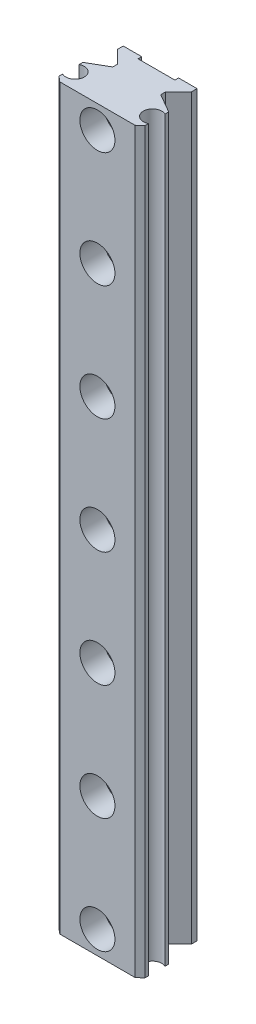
ISO-10303-21;
HEADER;
FILE_DESCRIPTION(('STEP AP214'),'2;1');
FILE_NAME('part.step','',(''),(''),'','','');
FILE_SCHEMA(('AUTOMOTIVE_DESIGN { 1 0 10303 214 1 1 1 1 }'));
ENDSEC;
DATA;
#1=APPLICATION_CONTEXT('core data for automotive mechanical design processes');
#2=APPLICATION_PROTOCOL_DEFINITION('international standard','automotive_design',2000,#1);
#3=PRODUCT_CONTEXT('',#1,'mechanical');
#4=PRODUCT('Part','Part','',(#3));
#5=PRODUCT_RELATED_PRODUCT_CATEGORY('part','',(#4));
#6=PRODUCT_DEFINITION_FORMATION('','',#4);
#7=PRODUCT_DEFINITION_CONTEXT('part definition',#1,'design');
#8=PRODUCT_DEFINITION('design','',#6,#7);
#9=PRODUCT_DEFINITION_SHAPE('','',#8);
#10=(LENGTH_UNIT() NAMED_UNIT(*) SI_UNIT(.MILLI.,.METRE.));
#11=(NAMED_UNIT(*) PLANE_ANGLE_UNIT() SI_UNIT($,.RADIAN.));
#12=(NAMED_UNIT(*) SI_UNIT($,.STERADIAN.) SOLID_ANGLE_UNIT());
#13=UNCERTAINTY_MEASURE_WITH_UNIT(LENGTH_MEASURE(1.E-05),#10,'distance_accuracy_value','');
#14=(GEOMETRIC_REPRESENTATION_CONTEXT(3) GLOBAL_UNCERTAINTY_ASSIGNED_CONTEXT((#13)) GLOBAL_UNIT_ASSIGNED_CONTEXT((#10,
#11,#12)) REPRESENTATION_CONTEXT('',''));
#15=CARTESIAN_POINT('',(0.,0.,0.));
#16=DIRECTION('',(0.,0.,1.));
#17=DIRECTION('',(1.,0.,0.));
#18=AXIS2_PLACEMENT_3D('',#15,#16,#17);
#19=CARTESIAN_POINT('',(0.,387.5,11.5));
#20=DIRECTION('',(0.,0.,1.));
#21=DIRECTION('',(0.,-1.,0.));
#22=AXIS2_PLACEMENT_3D('',#19,#20,#21);
#23=CYLINDRICAL_SURFACE('',#22,5.5);
#24=CARTESIAN_POINT('',(0.,387.5,1.99999999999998));
#25=DIRECTION('',(0.,0.,1.));
#26=DIRECTION('',(0.,-1.,0.));
#27=AXIS2_PLACEMENT_3D('',#24,#25,#26);
#28=CIRCLE('',#27,5.5);
#29=CARTESIAN_POINT('',(0.,382.,1.99999999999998));
#30=VERTEX_POINT('',#29);
#31=EDGE_CURVE('E346',#30,#30,#28,.T.);
#32=ORIENTED_EDGE('',*,*,#31,.F.);
#33=EDGE_LOOP('',(#32));
#34=FACE_BOUND('',#33,.T.);
#35=CARTESIAN_POINT('',(0.,387.5,21.));
#36=DIRECTION('',(0.,0.,1.));
#37=DIRECTION('',(0.,-1.,0.));
#38=AXIS2_PLACEMENT_3D('',#35,#36,#37);
#39=CIRCLE('',#38,5.5);
#40=CARTESIAN_POINT('',(0.,382.,21.));
#41=VERTEX_POINT('',#40);
#42=EDGE_CURVE('E19',#41,#41,#39,.T.);
#43=ORIENTED_EDGE('',*,*,#42,.T.);
#44=EDGE_LOOP('',(#43));
#45=FACE_BOUND('',#44,.T.);
#46=ADVANCED_FACE('F16',(#34,#45),#23,.F.);
#47=CARTESIAN_POINT('',(0.,325.,11.5));
#48=DIRECTION('',(0.,0.,1.));
#49=DIRECTION('',(0.,-1.,0.));
#50=AXIS2_PLACEMENT_3D('',#47,#48,#49);
#51=CYLINDRICAL_SURFACE('',#50,5.5);
#52=CARTESIAN_POINT('',(0.,325.,1.99999999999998));
#53=DIRECTION('',(0.,0.,1.));
#54=DIRECTION('',(0.,-1.,0.));
#55=AXIS2_PLACEMENT_3D('',#52,#53,#54);
#56=CIRCLE('',#55,5.5);
#57=CARTESIAN_POINT('',(0.,319.5,1.99999999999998));
#58=VERTEX_POINT('',#57);
#59=EDGE_CURVE('E483',#58,#58,#56,.T.);
#60=ORIENTED_EDGE('',*,*,#59,.F.);
#61=EDGE_LOOP('',(#60));
#62=FACE_BOUND('',#61,.T.);
#63=CARTESIAN_POINT('',(0.,325.,21.));
#64=DIRECTION('',(0.,0.,1.));
#65=DIRECTION('',(0.,-1.,0.));
#66=AXIS2_PLACEMENT_3D('',#63,#64,#65);
#67=CIRCLE('',#66,5.5);
#68=CARTESIAN_POINT('',(0.,319.5,21.));
#69=VERTEX_POINT('',#68);
#70=EDGE_CURVE('E501',#69,#69,#67,.T.);
#71=ORIENTED_EDGE('',*,*,#70,.T.);
#72=EDGE_LOOP('',(#71));
#73=FACE_BOUND('',#72,.T.);
#74=ADVANCED_FACE('F612',(#62,#73),#51,.F.);
#75=CARTESIAN_POINT('',(0.,262.5,11.5));
#76=DIRECTION('',(0.,0.,1.));
#77=DIRECTION('',(0.,-1.,0.));
#78=AXIS2_PLACEMENT_3D('',#75,#76,#77);
#79=CYLINDRICAL_SURFACE('',#78,5.5);
#80=CARTESIAN_POINT('',(0.,262.5,1.99999999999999));
#81=DIRECTION('',(0.,0.,1.));
#82=DIRECTION('',(0.,-1.,0.));
#83=AXIS2_PLACEMENT_3D('',#80,#81,#82);
#84=CIRCLE('',#83,5.5);
#85=CARTESIAN_POINT('',(0.,257.,1.99999999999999));
#86=VERTEX_POINT('',#85);
#87=EDGE_CURVE('E480',#86,#86,#84,.T.);
#88=ORIENTED_EDGE('',*,*,#87,.F.);
#89=EDGE_LOOP('',(#88));
#90=FACE_BOUND('',#89,.T.);
#91=CARTESIAN_POINT('',(0.,262.5,21.));
#92=DIRECTION('',(0.,0.,1.));
#93=DIRECTION('',(0.,-1.,0.));
#94=AXIS2_PLACEMENT_3D('',#91,#92,#93);
#95=CIRCLE('',#94,5.5);
#96=CARTESIAN_POINT('',(0.,257.,21.));
#97=VERTEX_POINT('',#96);
#98=EDGE_CURVE('E499',#97,#97,#95,.T.);
#99=ORIENTED_EDGE('',*,*,#98,.T.);
#100=EDGE_LOOP('',(#99));
#101=FACE_BOUND('',#100,.T.);
#102=ADVANCED_FACE('F609',(#90,#101),#79,.F.);
#103=CARTESIAN_POINT('',(0.,200.,11.5));
#104=DIRECTION('',(0.,0.,1.));
#105=DIRECTION('',(0.,-1.,0.));
#106=AXIS2_PLACEMENT_3D('',#103,#104,#105);
#107=CYLINDRICAL_SURFACE('',#106,5.5);
#108=CARTESIAN_POINT('',(0.,200.,1.99999999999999));
#109=DIRECTION('',(0.,0.,1.));
#110=DIRECTION('',(0.,-1.,0.));
#111=AXIS2_PLACEMENT_3D('',#108,#109,#110);
#112=CIRCLE('',#111,5.5);
#113=CARTESIAN_POINT('',(0.,194.5,1.99999999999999));
#114=VERTEX_POINT('',#113);
#115=EDGE_CURVE('E477',#114,#114,#112,.T.);
#116=ORIENTED_EDGE('',*,*,#115,.F.);
#117=EDGE_LOOP('',(#116));
#118=FACE_BOUND('',#117,.T.);
#119=CARTESIAN_POINT('',(0.,200.,21.));
#120=DIRECTION('',(0.,0.,1.));
#121=DIRECTION('',(0.,-1.,0.));
#122=AXIS2_PLACEMENT_3D('',#119,#120,#121);
#123=CIRCLE('',#122,5.5);
#124=CARTESIAN_POINT('',(0.,194.5,21.));
#125=VERTEX_POINT('',#124);
#126=EDGE_CURVE('E496',#125,#125,#123,.T.);
#127=ORIENTED_EDGE('',*,*,#126,.T.);
#128=EDGE_LOOP('',(#127));
#129=FACE_BOUND('',#128,.T.);
#130=ADVANCED_FACE('F605',(#118,#129),#107,.F.);
#131=CARTESIAN_POINT('',(0.,137.5,11.5));
#132=DIRECTION('',(0.,0.,1.));
#133=DIRECTION('',(0.,-1.,0.));
#134=AXIS2_PLACEMENT_3D('',#131,#132,#133);
#135=CYLINDRICAL_SURFACE('',#134,5.5);
#136=CARTESIAN_POINT('',(0.,137.5,1.99999999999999));
#137=DIRECTION('',(0.,0.,1.));
#138=DIRECTION('',(0.,-1.,0.));
#139=AXIS2_PLACEMENT_3D('',#136,#137,#138);
#140=CIRCLE('',#139,5.5);
#141=CARTESIAN_POINT('',(0.,132.,1.99999999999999));
#142=VERTEX_POINT('',#141);
#143=EDGE_CURVE('E474',#142,#142,#140,.T.);
#144=ORIENTED_EDGE('',*,*,#143,.F.);
#145=EDGE_LOOP('',(#144));
#146=FACE_BOUND('',#145,.T.);
#147=CARTESIAN_POINT('',(0.,137.5,21.));
#148=DIRECTION('',(0.,0.,1.));
#149=DIRECTION('',(0.,-1.,0.));
#150=AXIS2_PLACEMENT_3D('',#147,#148,#149);
#151=CIRCLE('',#150,5.5);
#152=CARTESIAN_POINT('',(0.,132.,21.));
#153=VERTEX_POINT('',#152);
#154=EDGE_CURVE('E493',#153,#153,#151,.T.);
#155=ORIENTED_EDGE('',*,*,#154,.T.);
#156=EDGE_LOOP('',(#155));
#157=FACE_BOUND('',#156,.T.);
#158=ADVANCED_FACE('F601',(#146,#157),#135,.F.);
#159=CARTESIAN_POINT('',(0.,75.,11.5));
#160=DIRECTION('',(0.,0.,1.));
#161=DIRECTION('',(0.,-1.,0.));
#162=AXIS2_PLACEMENT_3D('',#159,#160,#161);
#163=CYLINDRICAL_SURFACE('',#162,5.5);
#164=CARTESIAN_POINT('',(0.,75.,2.));
#165=DIRECTION('',(0.,0.,1.));
#166=DIRECTION('',(0.,-1.,0.));
#167=AXIS2_PLACEMENT_3D('',#164,#165,#166);
#168=CIRCLE('',#167,5.5);
#169=CARTESIAN_POINT('',(0.,69.5,2.));
#170=VERTEX_POINT('',#169);
#171=EDGE_CURVE('E471',#170,#170,#168,.T.);
#172=ORIENTED_EDGE('',*,*,#171,.F.);
#173=EDGE_LOOP('',(#172));
#174=FACE_BOUND('',#173,.T.);
#175=CARTESIAN_POINT('',(0.,75.,21.));
#176=DIRECTION('',(0.,0.,1.));
#177=DIRECTION('',(0.,-1.,0.));
#178=AXIS2_PLACEMENT_3D('',#175,#176,#177);
#179=CIRCLE('',#178,5.5);
#180=CARTESIAN_POINT('',(0.,69.5,21.));
#181=VERTEX_POINT('',#180);
#182=EDGE_CURVE('E490',#181,#181,#179,.T.);
#183=ORIENTED_EDGE('',*,*,#182,.T.);
#184=EDGE_LOOP('',(#183));
#185=FACE_BOUND('',#184,.T.);
#186=ADVANCED_FACE('F597',(#174,#185),#163,.F.);
#187=CARTESIAN_POINT('',(0.,12.5,11.5));
#188=DIRECTION('',(0.,0.,1.));
#189=DIRECTION('',(0.,-1.,0.));
#190=AXIS2_PLACEMENT_3D('',#187,#188,#189);
#191=CYLINDRICAL_SURFACE('',#190,5.5);
#192=CARTESIAN_POINT('',(0.,12.5,2.));
#193=DIRECTION('',(0.,0.,1.));
#194=DIRECTION('',(0.,-1.,0.));
#195=AXIS2_PLACEMENT_3D('',#192,#193,#194);
#196=CIRCLE('',#195,5.5);
#197=CARTESIAN_POINT('',(0.,7.,2.));
#198=VERTEX_POINT('',#197);
#199=EDGE_CURVE('E336',#198,#198,#196,.T.);
#200=ORIENTED_EDGE('',*,*,#199,.F.);
#201=EDGE_LOOP('',(#200));
#202=FACE_BOUND('',#201,.T.);
#203=CARTESIAN_POINT('',(0.,12.5,21.));
#204=DIRECTION('',(0.,0.,1.));
#205=DIRECTION('',(0.,-1.,0.));
#206=AXIS2_PLACEMENT_3D('',#203,#204,#205);
#207=CIRCLE('',#206,5.5);
#208=CARTESIAN_POINT('',(0.,7.,21.));
#209=VERTEX_POINT('',#208);
#210=EDGE_CURVE('E347',#209,#209,#207,.T.);
#211=ORIENTED_EDGE('',*,*,#210,.T.);
#212=EDGE_LOOP('',(#211));
#213=FACE_BOUND('',#212,.T.);
#214=ADVANCED_FACE('F513',(#202,#213),#191,.F.);
#215=CARTESIAN_POINT('',(7.5,387.5,21.));
#216=DIRECTION('',(0.,0.,-1.));
#217=DIRECTION('',(0.,1.,0.));
#218=AXIS2_PLACEMENT_3D('',#215,#216,#217);
#219=PLANE('',#218);
#220=ORIENTED_EDGE('',*,*,#42,.F.);
#221=EDGE_LOOP('',(#220));
#222=FACE_BOUND('',#221,.T.);
#223=CARTESIAN_POINT('',(0.,387.5,21.));
#224=DIRECTION('',(0.,0.,1.));
#225=DIRECTION('',(0.,-1.,0.));
#226=AXIS2_PLACEMENT_3D('',#223,#224,#225);
#227=CIRCLE('',#226,9.5);
#228=CARTESIAN_POINT('',(0.,378.,21.));
#229=VERTEX_POINT('',#228);
#230=EDGE_CURVE('E184',#229,#229,#227,.T.);
#231=ORIENTED_EDGE('',*,*,#230,.T.);
#232=EDGE_LOOP('',(#231));
#233=FACE_BOUND('',#232,.T.);
#234=ADVANCED_FACE('F509',(#222,#233),#219,.F.);
#235=CARTESIAN_POINT('',(7.5,325.,21.));
#236=DIRECTION('',(0.,0.,-1.));
#237=DIRECTION('',(0.,1.,0.));
#238=AXIS2_PLACEMENT_3D('',#235,#236,#237);
#239=PLANE('',#238);
#240=ORIENTED_EDGE('',*,*,#70,.F.);
#241=EDGE_LOOP('',(#240));
#242=FACE_BOUND('',#241,.T.);
#243=CARTESIAN_POINT('',(0.,325.,21.));
#244=DIRECTION('',(0.,0.,1.));
#245=DIRECTION('',(0.,-1.,0.));
#246=AXIS2_PLACEMENT_3D('',#243,#244,#245);
#247=CIRCLE('',#246,9.5);
#248=CARTESIAN_POINT('',(0.,315.5,21.));
#249=VERTEX_POINT('',#248);
#250=EDGE_CURVE('E464',#249,#249,#247,.T.);
#251=ORIENTED_EDGE('',*,*,#250,.T.);
#252=EDGE_LOOP('',(#251));
#253=FACE_BOUND('',#252,.T.);
#254=ADVANCED_FACE('F512',(#242,#253),#239,.F.);
#255=CARTESIAN_POINT('',(7.5,262.5,21.));
#256=DIRECTION('',(0.,0.,-1.));
#257=DIRECTION('',(0.,1.,0.));
#258=AXIS2_PLACEMENT_3D('',#255,#256,#257);
#259=PLANE('',#258);
#260=ORIENTED_EDGE('',*,*,#98,.F.);
#261=EDGE_LOOP('',(#260));
#262=FACE_BOUND('',#261,.T.);
#263=CARTESIAN_POINT('',(0.,262.5,21.));
#264=DIRECTION('',(0.,0.,1.));
#265=DIRECTION('',(0.,-1.,0.));
#266=AXIS2_PLACEMENT_3D('',#263,#264,#265);
#267=CIRCLE('',#266,9.5);
#268=CARTESIAN_POINT('',(0.,253.,21.));
#269=VERTEX_POINT('',#268);
#270=EDGE_CURVE('E461',#269,#269,#267,.T.);
#271=ORIENTED_EDGE('',*,*,#270,.T.);
#272=EDGE_LOOP('',(#271));
#273=FACE_BOUND('',#272,.T.);
#274=ADVANCED_FACE('F578',(#262,#273),#259,.F.);
#275=CARTESIAN_POINT('',(7.5,200.,21.));
#276=DIRECTION('',(0.,0.,-1.));
#277=DIRECTION('',(0.,1.,0.));
#278=AXIS2_PLACEMENT_3D('',#275,#276,#277);
#279=PLANE('',#278);
#280=ORIENTED_EDGE('',*,*,#126,.F.);
#281=EDGE_LOOP('',(#280));
#282=FACE_BOUND('',#281,.T.);
#283=CARTESIAN_POINT('',(0.,200.,21.));
#284=DIRECTION('',(0.,0.,1.));
#285=DIRECTION('',(0.,-1.,0.));
#286=AXIS2_PLACEMENT_3D('',#283,#284,#285);
#287=CIRCLE('',#286,9.5);
#288=CARTESIAN_POINT('',(0.,190.5,21.));
#289=VERTEX_POINT('',#288);
#290=EDGE_CURVE('E458',#289,#289,#287,.T.);
#291=ORIENTED_EDGE('',*,*,#290,.T.);
#292=EDGE_LOOP('',(#291));
#293=FACE_BOUND('',#292,.T.);
#294=ADVANCED_FACE('F580',(#282,#293),#279,.F.);
#295=CARTESIAN_POINT('',(7.5,137.5,21.));
#296=DIRECTION('',(0.,0.,-1.));
#297=DIRECTION('',(0.,1.,0.));
#298=AXIS2_PLACEMENT_3D('',#295,#296,#297);
#299=PLANE('',#298);
#300=ORIENTED_EDGE('',*,*,#154,.F.);
#301=EDGE_LOOP('',(#300));
#302=FACE_BOUND('',#301,.T.);
#303=CARTESIAN_POINT('',(0.,137.5,21.));
#304=DIRECTION('',(0.,0.,1.));
#305=DIRECTION('',(0.,-1.,0.));
#306=AXIS2_PLACEMENT_3D('',#303,#304,#305);
#307=CIRCLE('',#306,9.5);
#308=CARTESIAN_POINT('',(0.,128.,21.));
#309=VERTEX_POINT('',#308);
#310=EDGE_CURVE('E455',#309,#309,#307,.T.);
#311=ORIENTED_EDGE('',*,*,#310,.T.);
#312=EDGE_LOOP('',(#311));
#313=FACE_BOUND('',#312,.T.);
#314=ADVANCED_FACE('F587',(#302,#313),#299,.F.);
#315=CARTESIAN_POINT('',(7.5,75.,21.));
#316=DIRECTION('',(0.,0.,-1.));
#317=DIRECTION('',(0.,1.,0.));
#318=AXIS2_PLACEMENT_3D('',#315,#316,#317);
#319=PLANE('',#318);
#320=ORIENTED_EDGE('',*,*,#182,.F.);
#321=EDGE_LOOP('',(#320));
#322=FACE_BOUND('',#321,.T.);
#323=CARTESIAN_POINT('',(0.,75.,21.));
#324=DIRECTION('',(0.,0.,1.));
#325=DIRECTION('',(0.,-1.,0.));
#326=AXIS2_PLACEMENT_3D('',#323,#324,#325);
#327=CIRCLE('',#326,9.5);
#328=CARTESIAN_POINT('',(0.,65.5,21.));
#329=VERTEX_POINT('',#328);
#330=EDGE_CURVE('E452',#329,#329,#327,.T.);
#331=ORIENTED_EDGE('',*,*,#330,.T.);
#332=EDGE_LOOP('',(#331));
#333=FACE_BOUND('',#332,.T.);
#334=ADVANCED_FACE('F650',(#322,#333),#319,.F.);
#335=CARTESIAN_POINT('',(7.5,12.5,21.));
#336=DIRECTION('',(0.,0.,-1.));
#337=DIRECTION('',(0.,1.,0.));
#338=AXIS2_PLACEMENT_3D('',#335,#336,#337);
#339=PLANE('',#338);
#340=ORIENTED_EDGE('',*,*,#210,.F.);
#341=EDGE_LOOP('',(#340));
#342=FACE_BOUND('',#341,.T.);
#343=CARTESIAN_POINT('',(0.,12.5,21.));
#344=DIRECTION('',(0.,0.,1.));
#345=DIRECTION('',(0.,-1.,0.));
#346=AXIS2_PLACEMENT_3D('',#343,#344,#345);
#347=CIRCLE('',#346,9.5);
#348=CARTESIAN_POINT('',(0.,3.,21.));
#349=VERTEX_POINT('',#348);
#350=EDGE_CURVE('E408',#349,#349,#347,.T.);
#351=ORIENTED_EDGE('',*,*,#350,.T.);
#352=EDGE_LOOP('',(#351));
#353=FACE_BOUND('',#352,.T.);
#354=ADVANCED_FACE('F646',(#342,#353),#339,.F.);
#355=CARTESIAN_POINT('',(-15.,0.,0.));
#356=DIRECTION('',(0.,0.,-1.));
#357=DIRECTION('',(0.,1.,0.));
#358=AXIS2_PLACEMENT_3D('',#355,#356,#357);
#359=PLANE('',#358);
#360=DIRECTION('',(1.,0.,0.));
#361=VECTOR('',#360,1.);
#362=CARTESIAN_POINT('',(0.,0.,0.));
#363=LINE('',#362,#361);
#364=CARTESIAN_POINT('',(-20.,0.,0.));
#365=VERTEX_POINT('',#364);
#366=CARTESIAN_POINT('',(-10.,0.,0.));
#367=VERTEX_POINT('',#366);
#368=EDGE_CURVE('E240',#365,#367,#363,.T.);
#369=ORIENTED_EDGE('',*,*,#368,.F.);
#370=DIRECTION('',(0.,1.,0.));
#371=VECTOR('',#370,1.);
#372=CARTESIAN_POINT('',(-20.,0.,0.));
#373=LINE('',#372,#371);
#374=CARTESIAN_POINT('',(-20.,400.,0.));
#375=VERTEX_POINT('',#374);
#376=EDGE_CURVE('E207',#375,#365,#373,.F.);
#377=ORIENTED_EDGE('',*,*,#376,.F.);
#378=DIRECTION('',(1.,0.,0.));
#379=VECTOR('',#378,1.);
#380=CARTESIAN_POINT('',(0.,400.,0.));
#381=LINE('',#380,#379);
#382=CARTESIAN_POINT('',(-10.,400.,0.));
#383=VERTEX_POINT('',#382);
#384=EDGE_CURVE('E413',#375,#383,#381,.T.);
#385=ORIENTED_EDGE('',*,*,#384,.T.);
#386=DIRECTION('',(0.,1.,0.));
#387=VECTOR('',#386,1.);
#388=CARTESIAN_POINT('',(-10.,0.,0.));
#389=LINE('',#388,#387);
#390=EDGE_CURVE('E343',#367,#383,#389,.T.);
#391=ORIENTED_EDGE('',*,*,#390,.F.);
#392=EDGE_LOOP('',(#369,#377,#385,#391));
#393=FACE_BOUND('',#392,.T.);
#394=ADVANCED_FACE('F637',(#393),#359,.T.);
#395=CARTESIAN_POINT('',(-10.,0.,1.));
#396=DIRECTION('',(1.,0.,0.));
#397=DIRECTION('',(0.,0.,-1.));
#398=AXIS2_PLACEMENT_3D('',#395,#396,#397);
#399=PLANE('',#398);
#400=DIRECTION('',(0.,0.,-1.));
#401=VECTOR('',#400,1.);
#402=CARTESIAN_POINT('',(-10.,0.,17.7123774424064));
#403=LINE('',#402,#401);
#404=CARTESIAN_POINT('',(-10.,0.,2.));
#405=VERTEX_POINT('',#404);
#406=EDGE_CURVE('E332',#367,#405,#403,.F.);
#407=ORIENTED_EDGE('',*,*,#406,.F.);
#408=ORIENTED_EDGE('',*,*,#390,.T.);
#409=DIRECTION('',(0.,0.,-1.));
#410=VECTOR('',#409,1.);
#411=CARTESIAN_POINT('',(-10.,400.,17.7123774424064));
#412=LINE('',#411,#410);
#413=CARTESIAN_POINT('',(-10.,400.,1.99999999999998));
#414=VERTEX_POINT('',#413);
#415=EDGE_CURVE('E366',#383,#414,#412,.F.);
#416=ORIENTED_EDGE('',*,*,#415,.T.);
#417=DIRECTION('',(0.,1.,0.));
#418=VECTOR('',#417,1.);
#419=CARTESIAN_POINT('',(-10.,0.,2.));
#420=LINE('',#419,#418);
#421=EDGE_CURVE('E327',#405,#414,#420,.T.);
#422=ORIENTED_EDGE('',*,*,#421,.F.);
#423=EDGE_LOOP('',(#407,#408,#416,#422));
#424=FACE_BOUND('',#423,.T.);
#425=ADVANCED_FACE('F626',(#424),#399,.T.);
#426=CARTESIAN_POINT('',(0.,0.,2.));
#427=DIRECTION('',(0.,0.,-1.));
#428=DIRECTION('',(0.,1.,0.));
#429=AXIS2_PLACEMENT_3D('',#426,#427,#428);
#430=PLANE('',#429);
#431=DIRECTION('',(1.,0.,0.));
#432=VECTOR('',#431,1.);
#433=CARTESIAN_POINT('',(0.,0.,2.));
#434=LINE('',#433,#432);
#435=CARTESIAN_POINT('',(10.,0.,2.));
#436=VERTEX_POINT('',#435);
#437=EDGE_CURVE('E322',#405,#436,#434,.T.);
#438=ORIENTED_EDGE('',*,*,#437,.F.);
#439=ORIENTED_EDGE('',*,*,#421,.T.);
#440=DIRECTION('',(1.,0.,0.));
#441=VECTOR('',#440,1.);
#442=CARTESIAN_POINT('',(0.,400.,1.99999999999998));
#443=LINE('',#442,#441);
#444=CARTESIAN_POINT('',(10.,400.,1.99999999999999));
#445=VERTEX_POINT('',#444);
#446=EDGE_CURVE('E404',#414,#445,#443,.T.);
#447=ORIENTED_EDGE('',*,*,#446,.T.);
#448=DIRECTION('',(0.,1.,0.));
#449=VECTOR('',#448,1.);
#450=CARTESIAN_POINT('',(10.,0.,2.));
#451=LINE('',#450,#449);
#452=EDGE_CURVE('E317',#436,#445,#451,.T.);
#453=ORIENTED_EDGE('',*,*,#452,.F.);
#454=EDGE_LOOP('',(#438,#439,#447,#453));
#455=FACE_BOUND('',#454,.T.);
#456=ORIENTED_EDGE('',*,*,#199,.T.);
#457=EDGE_LOOP('',(#456));
#458=FACE_BOUND('',#457,.T.);
#459=ORIENTED_EDGE('',*,*,#171,.T.);
#460=EDGE_LOOP('',(#459));
#461=FACE_BOUND('',#460,.T.);
#462=ORIENTED_EDGE('',*,*,#143,.T.);
#463=EDGE_LOOP('',(#462));
#464=FACE_BOUND('',#463,.T.);
#465=ORIENTED_EDGE('',*,*,#115,.T.);
#466=EDGE_LOOP('',(#465));
#467=FACE_BOUND('',#466,.T.);
#468=ORIENTED_EDGE('',*,*,#87,.T.);
#469=EDGE_LOOP('',(#468));
#470=FACE_BOUND('',#469,.T.);
#471=ORIENTED_EDGE('',*,*,#59,.T.);
#472=EDGE_LOOP('',(#471));
#473=FACE_BOUND('',#472,.T.);
#474=ORIENTED_EDGE('',*,*,#31,.T.);
#475=EDGE_LOOP('',(#474));
#476=FACE_BOUND('',#475,.T.);
#477=ADVANCED_FACE('F622',(#455,#458,#461,#464,#467,#470,#473,#476),#430,.T.);
#478=CARTESIAN_POINT('',(10.,0.,1.));
#479=DIRECTION('',(-1.,0.,0.));
#480=DIRECTION('',(0.,0.,1.));
#481=AXIS2_PLACEMENT_3D('',#478,#479,#480);
#482=PLANE('',#481);
#483=DIRECTION('',(0.,0.,-1.));
#484=VECTOR('',#483,1.);
#485=CARTESIAN_POINT('',(10.,0.,17.7123774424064));
#486=LINE('',#485,#484);
#487=CARTESIAN_POINT('',(10.,0.,0.));
#488=VERTEX_POINT('',#487);
#489=EDGE_CURVE('E312',#436,#488,#486,.T.);
#490=ORIENTED_EDGE('',*,*,#489,.F.);
#491=ORIENTED_EDGE('',*,*,#452,.T.);
#492=DIRECTION('',(0.,0.,-1.));
#493=VECTOR('',#492,1.);
#494=CARTESIAN_POINT('',(10.,400.,17.7123774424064));
#495=LINE('',#494,#493);
#496=CARTESIAN_POINT('',(10.,400.,0.));
#497=VERTEX_POINT('',#496);
#498=EDGE_CURVE('E400',#445,#497,#495,.T.);
#499=ORIENTED_EDGE('',*,*,#498,.T.);
#500=DIRECTION('',(0.,1.,0.));
#501=VECTOR('',#500,1.);
#502=CARTESIAN_POINT('',(10.,0.,0.));
#503=LINE('',#502,#501);
#504=EDGE_CURVE('E307',#488,#497,#503,.T.);
#505=ORIENTED_EDGE('',*,*,#504,.F.);
#506=EDGE_LOOP('',(#490,#491,#499,#505));
#507=FACE_BOUND('',#506,.T.);
#508=ADVANCED_FACE('F625',(#507),#482,.T.);
#509=CARTESIAN_POINT('',(15.,0.,0.));
#510=DIRECTION('',(0.,0.,-1.));
#511=DIRECTION('',(0.,1.,0.));
#512=AXIS2_PLACEMENT_3D('',#509,#510,#511);
#513=PLANE('',#512);
#514=DIRECTION('',(1.,0.,0.));
#515=VECTOR('',#514,1.);
#516=CARTESIAN_POINT('',(0.,0.,0.));
#517=LINE('',#516,#515);
#518=CARTESIAN_POINT('',(20.,0.,0.));
#519=VERTEX_POINT('',#518);
#520=EDGE_CURVE('E302',#488,#519,#517,.T.);
#521=ORIENTED_EDGE('',*,*,#520,.F.);
#522=ORIENTED_EDGE('',*,*,#504,.T.);
#523=DIRECTION('',(1.,0.,0.));
#524=VECTOR('',#523,1.);
#525=CARTESIAN_POINT('',(0.,400.,0.));
#526=LINE('',#525,#524);
#527=CARTESIAN_POINT('',(20.,400.,0.));
#528=VERTEX_POINT('',#527);
#529=EDGE_CURVE('E396',#497,#528,#526,.T.);
#530=ORIENTED_EDGE('',*,*,#529,.T.);
#531=DIRECTION('',(0.,1.,0.));
#532=VECTOR('',#531,1.);
#533=CARTESIAN_POINT('',(20.,0.,0.));
#534=LINE('',#533,#532);
#535=EDGE_CURVE('E297',#519,#528,#534,.T.);
#536=ORIENTED_EDGE('',*,*,#535,.F.);
#537=EDGE_LOOP('',(#521,#522,#530,#536));
#538=FACE_BOUND('',#537,.T.);
#539=ADVANCED_FACE('F634',(#538),#513,.T.);
#540=CARTESIAN_POINT('',(20.,0.,1.5));
#541=DIRECTION('',(1.,0.,0.));
#542=DIRECTION('',(0.,0.,-1.));
#543=AXIS2_PLACEMENT_3D('',#540,#541,#542);
#544=PLANE('',#543);
#545=DIRECTION('',(0.,0.,-1.));
#546=VECTOR('',#545,1.);
#547=CARTESIAN_POINT('',(20.,0.,17.7123774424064));
#548=LINE('',#547,#546);
#549=CARTESIAN_POINT('',(20.,0.,3.));
#550=VERTEX_POINT('',#549);
#551=EDGE_CURVE('E292',#519,#550,#548,.F.);
#552=ORIENTED_EDGE('',*,*,#551,.F.);
#553=ORIENTED_EDGE('',*,*,#535,.T.);
#554=DIRECTION('',(0.,0.,-1.));
#555=VECTOR('',#554,1.);
#556=CARTESIAN_POINT('',(20.,400.,17.7123774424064));
#557=LINE('',#556,#555);
#558=CARTESIAN_POINT('',(20.,400.,2.99999999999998));
#559=VERTEX_POINT('',#558);
#560=EDGE_CURVE('E392',#528,#559,#557,.F.);
#561=ORIENTED_EDGE('',*,*,#560,.T.);
#562=DIRECTION('',(0.,1.,0.));
#563=VECTOR('',#562,1.);
#564=CARTESIAN_POINT('',(20.,0.,3.));
#565=LINE('',#564,#563);
#566=EDGE_CURVE('E287',#550,#559,#565,.T.);
#567=ORIENTED_EDGE('',*,*,#566,.F.);
#568=EDGE_LOOP('',(#552,#553,#561,#567));
#569=FACE_BOUND('',#568,.T.);
#570=ADVANCED_FACE('F699',(#569),#544,.T.);
#571=CARTESIAN_POINT('',(16.5,0.,6.5));
#572=DIRECTION('',(0.707106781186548,0.,0.707106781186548));
#573=DIRECTION('',(0.707106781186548,0.,-0.707106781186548));
#574=AXIS2_PLACEMENT_3D('',#571,#572,#573);
#575=PLANE('',#574);
#576=DIRECTION('',(-0.707106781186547,0.,0.707106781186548));
#577=VECTOR('',#576,1.);
#578=CARTESIAN_POINT('',(20.,0.,3.));
#579=LINE('',#578,#577);
#580=CARTESIAN_POINT('',(13.,0.,10.));
#581=VERTEX_POINT('',#580);
#582=EDGE_CURVE('E282',#550,#581,#579,.T.);
#583=ORIENTED_EDGE('',*,*,#582,.F.);
#584=ORIENTED_EDGE('',*,*,#566,.T.);
#585=DIRECTION('',(-0.707106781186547,0.,0.707106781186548));
#586=VECTOR('',#585,1.);
#587=CARTESIAN_POINT('',(20.,400.,2.99999999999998));
#588=LINE('',#587,#586);
#589=CARTESIAN_POINT('',(13.,400.,9.99999999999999));
#590=VERTEX_POINT('',#589);
#591=EDGE_CURVE('E388',#559,#590,#588,.T.);
#592=ORIENTED_EDGE('',*,*,#591,.T.);
#593=DIRECTION('',(0.,1.,0.));
#594=VECTOR('',#593,1.);
#595=CARTESIAN_POINT('',(13.,0.,10.));
#596=LINE('',#595,#594);
#597=EDGE_CURVE('E277',#581,#590,#596,.T.);
#598=ORIENTED_EDGE('',*,*,#597,.F.);
#599=EDGE_LOOP('',(#583,#584,#592,#598));
#600=FACE_BOUND('',#599,.T.);
#601=ADVANCED_FACE('F706',(#600),#575,.T.);
#602=CARTESIAN_POINT('',(13.,0.,11.34107987));
#603=DIRECTION('',(1.,0.,0.));
#604=DIRECTION('',(0.,0.,-1.));
#605=AXIS2_PLACEMENT_3D('',#602,#603,#604);
#606=PLANE('',#605);
#607=DIRECTION('',(0.,0.,-1.));
#608=VECTOR('',#607,1.);
#609=CARTESIAN_POINT('',(13.,0.,17.7123774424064));
#610=LINE('',#609,#608);
#611=CARTESIAN_POINT('',(13.,0.,12.68215974));
#612=VERTEX_POINT('',#611);
#613=EDGE_CURVE('E272',#581,#612,#610,.F.);
#614=ORIENTED_EDGE('',*,*,#613,.F.);
#615=ORIENTED_EDGE('',*,*,#597,.T.);
#616=DIRECTION('',(0.,0.,-1.));
#617=VECTOR('',#616,1.);
#618=CARTESIAN_POINT('',(13.,400.,17.7123774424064));
#619=LINE('',#618,#617);
#620=CARTESIAN_POINT('',(13.,400.,12.68215974));
#621=VERTEX_POINT('',#620);
#622=EDGE_CURVE('E384',#590,#621,#619,.F.);
#623=ORIENTED_EDGE('',*,*,#622,.T.);
#624=DIRECTION('',(0.,1.,0.));
#625=VECTOR('',#624,1.);
#626=CARTESIAN_POINT('',(13.,0.,12.68215974));
#627=LINE('',#626,#625);
#628=EDGE_CURVE('E265',#612,#621,#627,.T.);
#629=ORIENTED_EDGE('',*,*,#628,.F.);
#630=EDGE_LOOP('',(#614,#615,#623,#629));
#631=FACE_BOUND('',#630,.T.);
#632=ADVANCED_FACE('F714',(#631),#606,.T.);
#633=CARTESIAN_POINT('',(18.125,0.,15.64107987));
#634=DIRECTION('',(0.500000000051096,0.,-0.866025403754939));
#635=DIRECTION('',(-0.866025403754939,0.,-0.500000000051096));
#636=AXIS2_PLACEMENT_3D('',#633,#634,#635);
#637=PLANE('',#636);
#638=DIRECTION('',(0.866025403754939,0.,0.500000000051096));
#639=VECTOR('',#638,1.);
#640=CARTESIAN_POINT('',(13.,0.,12.68215974));
#641=LINE('',#640,#639);
#642=CARTESIAN_POINT('',(23.25,0.,18.6));
#643=VERTEX_POINT('',#642);
#644=EDGE_CURVE('E268',#612,#643,#641,.T.);
#645=ORIENTED_EDGE('',*,*,#644,.F.);
#646=ORIENTED_EDGE('',*,*,#628,.T.);
#647=DIRECTION('',(0.866025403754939,0.,0.500000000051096));
#648=VECTOR('',#647,1.);
#649=CARTESIAN_POINT('',(13.,400.,12.68215974));
#650=LINE('',#649,#648);
#651=CARTESIAN_POINT('',(23.25,400.,18.6));
#652=VERTEX_POINT('',#651);
#653=EDGE_CURVE('E202',#621,#652,#650,.T.);
#654=ORIENTED_EDGE('',*,*,#653,.T.);
#655=DIRECTION('',(0.,1.,0.));
#656=VECTOR('',#655,1.);
#657=CARTESIAN_POINT('',(23.25,0.,18.6));
#658=LINE('',#657,#656);
#659=EDGE_CURVE('E263',#643,#652,#658,.T.);
#660=ORIENTED_EDGE('',*,*,#659,.F.);
#661=EDGE_LOOP('',(#645,#646,#654,#660));
#662=FACE_BOUND('',#661,.T.);
#663=ADVANCED_FACE('F722',(#662),#637,.T.);
#664=CARTESIAN_POINT('',(23.25,0.,19.617428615));
#665=DIRECTION('',(1.,0.,0.));
#666=DIRECTION('',(0.,0.,-1.));
#667=AXIS2_PLACEMENT_3D('',#664,#665,#666);
#668=PLANE('',#667);
#669=DIRECTION('',(0.,0.,-1.));
#670=VECTOR('',#669,1.);
#671=CARTESIAN_POINT('',(23.25,0.,17.7123774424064));
#672=LINE('',#671,#670);
#673=CARTESIAN_POINT('',(23.25,0.,20.63485723));
#674=VERTEX_POINT('',#673);
#675=EDGE_CURVE('E271',#643,#674,#672,.F.);
#676=ORIENTED_EDGE('',*,*,#675,.F.);
#677=ORIENTED_EDGE('',*,*,#659,.T.);
#678=DIRECTION('',(0.,0.,-1.));
#679=VECTOR('',#678,1.);
#680=CARTESIAN_POINT('',(23.25,400.,17.7123774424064));
#681=LINE('',#680,#679);
#682=CARTESIAN_POINT('',(23.25,400.,20.63485723));
#683=VERTEX_POINT('',#682);
#684=EDGE_CURVE('E162',#652,#683,#681,.F.);
#685=ORIENTED_EDGE('',*,*,#684,.T.);
#686=DIRECTION('',(0.,1.,0.));
#687=VECTOR('',#686,1.);
#688=CARTESIAN_POINT('',(23.25,0.,20.63485723));
#689=LINE('',#688,#687);
#690=EDGE_CURVE('E173',#674,#683,#689,.T.);
#691=ORIENTED_EDGE('',*,*,#690,.F.);
#692=EDGE_LOOP('',(#676,#677,#685,#691));
#693=FACE_BOUND('',#692,.T.);
#694=ADVANCED_FACE('F730',(#693),#668,.T.);
#695=CARTESIAN_POINT('',(21.0000000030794,0.,25.100000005));
#696=DIRECTION('',(0.,1.,0.));
#697=DIRECTION('',(0.,0.,1.));
#698=AXIS2_PLACEMENT_3D('',#695,#696,#697);
#699=CYLINDRICAL_SURFACE('',#698,4.99999999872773);
#700=CARTESIAN_POINT('',(21.0000000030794,0.,25.100000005));
#701=DIRECTION('',(0.,1.,0.));
#702=DIRECTION('',(0.,0.,1.));
#703=AXIS2_PLACEMENT_3D('',#700,#701,#702);
#704=CIRCLE('',#703,4.99999999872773);
#705=CARTESIAN_POINT('',(23.25,0.,29.56514278));
#706=VERTEX_POINT('',#705);
#707=EDGE_CURVE('E447',#674,#706,#704,.T.);
#708=ORIENTED_EDGE('',*,*,#707,.F.);
#709=ORIENTED_EDGE('',*,*,#690,.T.);
#710=CARTESIAN_POINT('',(21.0000000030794,400.,25.100000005));
#711=DIRECTION('',(0.,1.,0.));
#712=DIRECTION('',(0.,0.,1.));
#713=AXIS2_PLACEMENT_3D('',#710,#711,#712);
#714=CIRCLE('',#713,4.99999999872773);
#715=CARTESIAN_POINT('',(23.25,400.,29.56514278));
#716=VERTEX_POINT('',#715);
#717=EDGE_CURVE('E167',#683,#716,#714,.T.);
#718=ORIENTED_EDGE('',*,*,#717,.T.);
#719=DIRECTION('',(0.,1.,0.));
#720=VECTOR('',#719,1.);
#721=CARTESIAN_POINT('',(23.25,0.,29.56514278));
#722=LINE('',#721,#720);
#723=EDGE_CURVE('E171',#706,#716,#722,.T.);
#724=ORIENTED_EDGE('',*,*,#723,.F.);
#725=EDGE_LOOP('',(#708,#709,#718,#724));
#726=FACE_BOUND('',#725,.T.);
#727=ADVANCED_FACE('F170',(#726),#699,.F.);
#728=CARTESIAN_POINT('',(-23.25,0.,30.577571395));
#729=DIRECTION('',(-1.,0.,0.));
#730=DIRECTION('',(0.,0.,1.));
#731=AXIS2_PLACEMENT_3D('',#728,#729,#730);
#732=PLANE('',#731);
#733=DIRECTION('',(0.,0.,-1.));
#734=VECTOR('',#733,1.);
#735=CARTESIAN_POINT('',(-23.25,0.,17.7123774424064));
#736=LINE('',#735,#734);
#737=CARTESIAN_POINT('',(-23.25,0.,31.59000001));
#738=VERTEX_POINT('',#737);
#739=CARTESIAN_POINT('',(-23.25,0.,29.56514278));
#740=VERTEX_POINT('',#739);
#741=EDGE_CURVE('E235',#738,#740,#736,.T.);
#742=ORIENTED_EDGE('',*,*,#741,.F.);
#743=DIRECTION('',(0.,1.,0.));
#744=VECTOR('',#743,1.);
#745=CARTESIAN_POINT('',(-23.25,0.,31.59000001));
#746=LINE('',#745,#744);
#747=CARTESIAN_POINT('',(-23.25,400.,31.59000001));
#748=VERTEX_POINT('',#747);
#749=EDGE_CURVE('E238',#748,#738,#746,.F.);
#750=ORIENTED_EDGE('',*,*,#749,.F.);
#751=DIRECTION('',(0.,0.,-1.));
#752=VECTOR('',#751,1.);
#753=CARTESIAN_POINT('',(-23.25,400.,17.7123774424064));
#754=LINE('',#753,#752);
#755=CARTESIAN_POINT('',(-23.25,400.,29.56514278));
#756=VERTEX_POINT('',#755);
#757=EDGE_CURVE('E192',#748,#756,#754,.T.);
#758=ORIENTED_EDGE('',*,*,#757,.T.);
#759=DIRECTION('',(0.,1.,0.));
#760=VECTOR('',#759,1.);
#761=CARTESIAN_POINT('',(-23.25,0.,29.56514278));
#762=LINE('',#761,#760);
#763=EDGE_CURVE('E218',#740,#756,#762,.T.);
#764=ORIENTED_EDGE('',*,*,#763,.F.);
#765=EDGE_LOOP('',(#742,#750,#758,#764));
#766=FACE_BOUND('',#765,.T.);
#767=ADVANCED_FACE('F744',(#766),#732,.T.);
#768=CARTESIAN_POINT('',(-21.0000000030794,0.,25.100000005));
#769=DIRECTION('',(0.,1.,0.));
#770=DIRECTION('',(0.,0.,1.));
#771=AXIS2_PLACEMENT_3D('',#768,#769,#770);
#772=CYLINDRICAL_SURFACE('',#771,4.99999999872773);
#773=CARTESIAN_POINT('',(-21.0000000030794,0.,25.100000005));
#774=DIRECTION('',(0.,1.,0.));
#775=DIRECTION('',(0.,0.,1.));
#776=AXIS2_PLACEMENT_3D('',#773,#774,#775);
#777=CIRCLE('',#776,4.99999999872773);
#778=CARTESIAN_POINT('',(-23.25,0.,20.63485723));
#779=VERTEX_POINT('',#778);
#780=EDGE_CURVE('E444',#740,#779,#777,.T.);
#781=ORIENTED_EDGE('',*,*,#780,.F.);
#782=ORIENTED_EDGE('',*,*,#763,.T.);
#783=CARTESIAN_POINT('',(-21.0000000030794,400.,25.100000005));
#784=DIRECTION('',(0.,1.,0.));
#785=DIRECTION('',(0.,0.,1.));
#786=AXIS2_PLACEMENT_3D('',#783,#784,#785);
#787=CIRCLE('',#786,4.99999999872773);
#788=CARTESIAN_POINT('',(-23.25,400.,20.63485723));
#789=VERTEX_POINT('',#788);
#790=EDGE_CURVE('E194',#756,#789,#787,.T.);
#791=ORIENTED_EDGE('',*,*,#790,.T.);
#792=DIRECTION('',(0.,1.,0.));
#793=VECTOR('',#792,1.);
#794=CARTESIAN_POINT('',(-23.25,0.,20.63485723));
#795=LINE('',#794,#793);
#796=EDGE_CURVE('E215',#779,#789,#795,.T.);
#797=ORIENTED_EDGE('',*,*,#796,.F.);
#798=EDGE_LOOP('',(#781,#782,#791,#797));
#799=FACE_BOUND('',#798,.T.);
#800=ADVANCED_FACE('F751',(#799),#772,.F.);
#801=CARTESIAN_POINT('',(-23.25,0.,19.617428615));
#802=DIRECTION('',(-1.,0.,0.));
#803=DIRECTION('',(0.,0.,1.));
#804=AXIS2_PLACEMENT_3D('',#801,#802,#803);
#805=PLANE('',#804);
#806=DIRECTION('',(0.,0.,-1.));
#807=VECTOR('',#806,1.);
#808=CARTESIAN_POINT('',(-23.25,0.,17.7123774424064));
#809=LINE('',#808,#807);
#810=CARTESIAN_POINT('',(-23.25,0.,18.6));
#811=VERTEX_POINT('',#810);
#812=EDGE_CURVE('E223',#779,#811,#809,.T.);
#813=ORIENTED_EDGE('',*,*,#812,.F.);
#814=ORIENTED_EDGE('',*,*,#796,.T.);
#815=DIRECTION('',(0.,0.,-1.));
#816=VECTOR('',#815,1.);
#817=CARTESIAN_POINT('',(-23.25,400.,17.7123774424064));
#818=LINE('',#817,#816);
#819=CARTESIAN_POINT('',(-23.25,400.,18.6));
#820=VERTEX_POINT('',#819);
#821=EDGE_CURVE('E377',#789,#820,#818,.T.);
#822=ORIENTED_EDGE('',*,*,#821,.T.);
#823=DIRECTION('',(0.,1.,0.));
#824=VECTOR('',#823,1.);
#825=CARTESIAN_POINT('',(-23.25,0.,18.6));
#826=LINE('',#825,#824);
#827=EDGE_CURVE('E214',#811,#820,#826,.T.);
#828=ORIENTED_EDGE('',*,*,#827,.F.);
#829=EDGE_LOOP('',(#813,#814,#822,#828));
#830=FACE_BOUND('',#829,.T.);
#831=ADVANCED_FACE('F759',(#830),#805,.T.);
#832=CARTESIAN_POINT('',(-18.125,0.,15.64107987));
#833=DIRECTION('',(-0.500000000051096,0.,-0.866025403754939));
#834=DIRECTION('',(-0.866025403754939,0.,0.500000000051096));
#835=AXIS2_PLACEMENT_3D('',#832,#833,#834);
#836=PLANE('',#835);
#837=DIRECTION('',(0.866025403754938,0.,-0.500000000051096));
#838=VECTOR('',#837,1.);
#839=CARTESIAN_POINT('',(-23.25,0.,18.6));
#840=LINE('',#839,#838);
#841=CARTESIAN_POINT('',(-13.,0.,12.68215974));
#842=VERTEX_POINT('',#841);
#843=EDGE_CURVE('E219',#811,#842,#840,.T.);
#844=ORIENTED_EDGE('',*,*,#843,.F.);
#845=ORIENTED_EDGE('',*,*,#827,.T.);
#846=DIRECTION('',(0.866025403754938,0.,-0.500000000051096));
#847=VECTOR('',#846,1.);
#848=CARTESIAN_POINT('',(-23.25,400.,18.6));
#849=LINE('',#848,#847);
#850=CARTESIAN_POINT('',(-13.,400.,12.68215974));
#851=VERTEX_POINT('',#850);
#852=EDGE_CURVE('E374',#820,#851,#849,.T.);
#853=ORIENTED_EDGE('',*,*,#852,.T.);
#854=DIRECTION('',(0.,1.,0.));
#855=VECTOR('',#854,1.);
#856=CARTESIAN_POINT('',(-13.,0.,12.68215974));
#857=LINE('',#856,#855);
#858=EDGE_CURVE('E211',#842,#851,#857,.T.);
#859=ORIENTED_EDGE('',*,*,#858,.F.);
#860=EDGE_LOOP('',(#844,#845,#853,#859));
#861=FACE_BOUND('',#860,.T.);
#862=ADVANCED_FACE('F767',(#861),#836,.T.);
#863=CARTESIAN_POINT('',(-13.,0.,11.34107987));
#864=DIRECTION('',(-1.,0.,0.));
#865=DIRECTION('',(0.,0.,1.));
#866=AXIS2_PLACEMENT_3D('',#863,#864,#865);
#867=PLANE('',#866);
#868=DIRECTION('',(0.,0.,-1.));
#869=VECTOR('',#868,1.);
#870=CARTESIAN_POINT('',(-13.,0.,17.7123774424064));
#871=LINE('',#870,#869);
#872=CARTESIAN_POINT('',(-13.,0.,9.99999999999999));
#873=VERTEX_POINT('',#872);
#874=EDGE_CURVE('E222',#842,#873,#871,.T.);
#875=ORIENTED_EDGE('',*,*,#874,.F.);
#876=ORIENTED_EDGE('',*,*,#858,.T.);
#877=DIRECTION('',(0.,0.,-1.));
#878=VECTOR('',#877,1.);
#879=CARTESIAN_POINT('',(-13.,400.,17.7123774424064));
#880=LINE('',#879,#878);
#881=CARTESIAN_POINT('',(-13.,400.,9.99999999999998));
#882=VERTEX_POINT('',#881);
#883=EDGE_CURVE('E376',#851,#882,#880,.T.);
#884=ORIENTED_EDGE('',*,*,#883,.T.);
#885=DIRECTION('',(0.,1.,0.));
#886=VECTOR('',#885,1.);
#887=CARTESIAN_POINT('',(-13.,0.,10.));
#888=LINE('',#887,#886);
#889=EDGE_CURVE('E208',#873,#882,#888,.T.);
#890=ORIENTED_EDGE('',*,*,#889,.F.);
#891=EDGE_LOOP('',(#875,#876,#884,#890));
#892=FACE_BOUND('',#891,.T.);
#893=ADVANCED_FACE('F775',(#892),#867,.T.);
#894=CARTESIAN_POINT('',(-16.5,0.,6.5));
#895=DIRECTION('',(-0.707106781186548,0.,0.707106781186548));
#896=DIRECTION('',(0.707106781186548,0.,0.707106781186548));
#897=AXIS2_PLACEMENT_3D('',#894,#895,#896);
#898=PLANE('',#897);
#899=DIRECTION('',(-0.707106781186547,0.,-0.707106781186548));
#900=VECTOR('',#899,1.);
#901=CARTESIAN_POINT('',(-13.,0.,10.));
#902=LINE('',#901,#900);
#903=CARTESIAN_POINT('',(-20.,0.,2.99999999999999));
#904=VERTEX_POINT('',#903);
#905=EDGE_CURVE('E361',#873,#904,#902,.T.);
#906=ORIENTED_EDGE('',*,*,#905,.F.);
#907=ORIENTED_EDGE('',*,*,#889,.T.);
#908=DIRECTION('',(-0.707106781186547,0.,-0.707106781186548));
#909=VECTOR('',#908,1.);
#910=CARTESIAN_POINT('',(-13.,400.,9.99999999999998));
#911=LINE('',#910,#909);
#912=CARTESIAN_POINT('',(-20.,400.,2.99999999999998));
#913=VERTEX_POINT('',#912);
#914=EDGE_CURVE('E419',#882,#913,#911,.T.);
#915=ORIENTED_EDGE('',*,*,#914,.T.);
#916=DIRECTION('',(0.,1.,0.));
#917=VECTOR('',#916,1.);
#918=CARTESIAN_POINT('',(-20.,0.,3.));
#919=LINE('',#918,#917);
#920=EDGE_CURVE('E185',#904,#913,#919,.T.);
#921=ORIENTED_EDGE('',*,*,#920,.F.);
#922=EDGE_LOOP('',(#906,#907,#915,#921));
#923=FACE_BOUND('',#922,.T.);
#924=ADVANCED_FACE('F783',(#923),#898,.T.);
#925=CARTESIAN_POINT('',(-20.,0.,1.5));
#926=DIRECTION('',(-1.,0.,0.));
#927=DIRECTION('',(0.,0.,1.));
#928=AXIS2_PLACEMENT_3D('',#925,#926,#927);
#929=PLANE('',#928);
#930=DIRECTION('',(0.,0.,-1.));
#931=VECTOR('',#930,1.);
#932=CARTESIAN_POINT('',(-20.,0.,17.7123774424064));
#933=LINE('',#932,#931);
#934=EDGE_CURVE('E358',#904,#365,#933,.T.);
#935=ORIENTED_EDGE('',*,*,#934,.F.);
#936=ORIENTED_EDGE('',*,*,#920,.T.);
#937=DIRECTION('',(0.,0.,-1.));
#938=VECTOR('',#937,1.);
#939=CARTESIAN_POINT('',(-20.,400.,17.7123774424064));
#940=LINE('',#939,#938);
#941=EDGE_CURVE('E416',#913,#375,#940,.T.);
#942=ORIENTED_EDGE('',*,*,#941,.T.);
#943=ORIENTED_EDGE('',*,*,#376,.T.);
#944=EDGE_LOOP('',(#935,#936,#942,#943));
#945=FACE_BOUND('',#944,.T.);
#946=ADVANCED_FACE('F530',(#945),#929,.T.);
#947=CARTESIAN_POINT('',(23.25,0.,30.577571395));
#948=DIRECTION('',(1.,0.,0.));
#949=DIRECTION('',(0.,0.,-1.));
#950=AXIS2_PLACEMENT_3D('',#947,#948,#949);
#951=PLANE('',#950);
#952=DIRECTION('',(0.,0.,-1.));
#953=VECTOR('',#952,1.);
#954=CARTESIAN_POINT('',(23.25,0.,17.7123774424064));
#955=LINE('',#954,#953);
#956=CARTESIAN_POINT('',(23.25,0.,31.59000001));
#957=VERTEX_POINT('',#956);
#958=EDGE_CURVE('E182',#706,#957,#955,.F.);
#959=ORIENTED_EDGE('',*,*,#958,.F.);
#960=ORIENTED_EDGE('',*,*,#723,.T.);
#961=DIRECTION('',(0.,0.,-1.));
#962=VECTOR('',#961,1.);
#963=CARTESIAN_POINT('',(23.25,400.,17.7123774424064));
#964=LINE('',#963,#962);
#965=CARTESIAN_POINT('',(23.25,400.,31.59000001));
#966=VERTEX_POINT('',#965);
#967=EDGE_CURVE('E176',#716,#966,#964,.F.);
#968=ORIENTED_EDGE('',*,*,#967,.T.);
#969=DIRECTION('',(0.,1.,0.));
#970=VECTOR('',#969,1.);
#971=CARTESIAN_POINT('',(23.25,0.,31.59000001));
#972=LINE('',#971,#970);
#973=EDGE_CURVE('E254',#957,#966,#972,.T.);
#974=ORIENTED_EDGE('',*,*,#973,.F.);
#975=EDGE_LOOP('',(#959,#960,#968,#974));
#976=FACE_BOUND('',#975,.T.);
#977=ADVANCED_FACE('F179',(#976),#951,.T.);
#978=CARTESIAN_POINT('',(0.,387.5,27.5));
#979=DIRECTION('',(0.,0.,1.));
#980=DIRECTION('',(0.,-1.,0.));
#981=AXIS2_PLACEMENT_3D('',#978,#979,#980);
#982=CYLINDRICAL_SURFACE('',#981,9.5);
#983=CARTESIAN_POINT('',(0.,387.5,34.));
#984=DIRECTION('',(0.,0.,1.));
#985=DIRECTION('',(0.,-1.,0.));
#986=AXIS2_PLACEMENT_3D('',#983,#984,#985);
#987=CIRCLE('',#986,9.5);
#988=CARTESIAN_POINT('',(0.,378.,34.));
#989=VERTEX_POINT('',#988);
#990=EDGE_CURVE('E256',#989,#989,#987,.F.);
#991=ORIENTED_EDGE('',*,*,#990,.F.);
#992=EDGE_LOOP('',(#991));
#993=FACE_BOUND('',#992,.T.);
#994=ORIENTED_EDGE('',*,*,#230,.F.);
#995=EDGE_LOOP('',(#994));
#996=FACE_BOUND('',#995,.T.);
#997=ADVANCED_FACE('F517',(#993,#996),#982,.F.);
#998=CARTESIAN_POINT('',(0.,325.,27.5));
#999=DIRECTION('',(0.,0.,1.));
#1000=DIRECTION('',(0.,-1.,0.));
#1001=AXIS2_PLACEMENT_3D('',#998,#999,#1000);
#1002=CYLINDRICAL_SURFACE('',#1001,9.5);
#1003=CARTESIAN_POINT('',(0.,325.,34.));
#1004=DIRECTION('',(0.,0.,1.));
#1005=DIRECTION('',(0.,-1.,0.));
#1006=AXIS2_PLACEMENT_3D('',#1003,#1004,#1005);
#1007=CIRCLE('',#1006,9.5);
#1008=CARTESIAN_POINT('',(0.,315.5,34.));
#1009=VERTEX_POINT('',#1008);
#1010=EDGE_CURVE('E439',#1009,#1009,#1007,.F.);
#1011=ORIENTED_EDGE('',*,*,#1010,.F.);
#1012=EDGE_LOOP('',(#1011));
#1013=FACE_BOUND('',#1012,.T.);
#1014=ORIENTED_EDGE('',*,*,#250,.F.);
#1015=EDGE_LOOP('',(#1014));
#1016=FACE_BOUND('',#1015,.T.);
#1017=ADVANCED_FACE('F519',(#1013,#1016),#1002,.F.);
#1018=CARTESIAN_POINT('',(0.,262.5,27.5));
#1019=DIRECTION('',(0.,0.,1.));
#1020=DIRECTION('',(0.,-1.,0.));
#1021=AXIS2_PLACEMENT_3D('',#1018,#1019,#1020);
#1022=CYLINDRICAL_SURFACE('',#1021,9.5);
#1023=CARTESIAN_POINT('',(0.,262.5,34.));
#1024=DIRECTION('',(0.,0.,1.));
#1025=DIRECTION('',(0.,-1.,0.));
#1026=AXIS2_PLACEMENT_3D('',#1023,#1024,#1025);
#1027=CIRCLE('',#1026,9.5);
#1028=CARTESIAN_POINT('',(0.,253.,34.));
#1029=VERTEX_POINT('',#1028);
#1030=EDGE_CURVE('E436',#1029,#1029,#1027,.F.);
#1031=ORIENTED_EDGE('',*,*,#1030,.F.);
#1032=EDGE_LOOP('',(#1031));
#1033=FACE_BOUND('',#1032,.T.);
#1034=ORIENTED_EDGE('',*,*,#270,.F.);
#1035=EDGE_LOOP('',(#1034));
#1036=FACE_BOUND('',#1035,.T.);
#1037=ADVANCED_FACE('F527',(#1033,#1036),#1022,.F.);
#1038=CARTESIAN_POINT('',(0.,200.,27.5));
#1039=DIRECTION('',(0.,0.,1.));
#1040=DIRECTION('',(0.,-1.,0.));
#1041=AXIS2_PLACEMENT_3D('',#1038,#1039,#1040);
#1042=CYLINDRICAL_SURFACE('',#1041,9.5);
#1043=CARTESIAN_POINT('',(0.,200.,34.));
#1044=DIRECTION('',(0.,0.,1.));
#1045=DIRECTION('',(0.,-1.,0.));
#1046=AXIS2_PLACEMENT_3D('',#1043,#1044,#1045);
#1047=CIRCLE('',#1046,9.5);
#1048=CARTESIAN_POINT('',(0.,190.5,34.));
#1049=VERTEX_POINT('',#1048);
#1050=EDGE_CURVE('E433',#1049,#1049,#1047,.F.);
#1051=ORIENTED_EDGE('',*,*,#1050,.F.);
#1052=EDGE_LOOP('',(#1051));
#1053=FACE_BOUND('',#1052,.T.);
#1054=ORIENTED_EDGE('',*,*,#290,.F.);
#1055=EDGE_LOOP('',(#1054));
#1056=FACE_BOUND('',#1055,.T.);
#1057=ADVANCED_FACE('F565',(#1053,#1056),#1042,.F.);
#1058=CARTESIAN_POINT('',(0.,137.5,27.5));
#1059=DIRECTION('',(0.,0.,1.));
#1060=DIRECTION('',(0.,-1.,0.));
#1061=AXIS2_PLACEMENT_3D('',#1058,#1059,#1060);
#1062=CYLINDRICAL_SURFACE('',#1061,9.5);
#1063=CARTESIAN_POINT('',(0.,137.5,34.));
#1064=DIRECTION('',(0.,0.,1.));
#1065=DIRECTION('',(0.,-1.,0.));
#1066=AXIS2_PLACEMENT_3D('',#1063,#1064,#1065);
#1067=CIRCLE('',#1066,9.5);
#1068=CARTESIAN_POINT('',(0.,128.,34.));
#1069=VERTEX_POINT('',#1068);
#1070=EDGE_CURVE('E430',#1069,#1069,#1067,.F.);
#1071=ORIENTED_EDGE('',*,*,#1070,.F.);
#1072=EDGE_LOOP('',(#1071));
#1073=FACE_BOUND('',#1072,.T.);
#1074=ORIENTED_EDGE('',*,*,#310,.F.);
#1075=EDGE_LOOP('',(#1074));
#1076=FACE_BOUND('',#1075,.T.);
#1077=ADVANCED_FACE('F561',(#1073,#1076),#1062,.F.);
#1078=CARTESIAN_POINT('',(0.,75.,27.5));
#1079=DIRECTION('',(0.,0.,1.));
#1080=DIRECTION('',(0.,-1.,0.));
#1081=AXIS2_PLACEMENT_3D('',#1078,#1079,#1080);
#1082=CYLINDRICAL_SURFACE('',#1081,9.5);
#1083=CARTESIAN_POINT('',(0.,75.,34.));
#1084=DIRECTION('',(0.,0.,1.));
#1085=DIRECTION('',(0.,-1.,0.));
#1086=AXIS2_PLACEMENT_3D('',#1083,#1084,#1085);
#1087=CIRCLE('',#1086,9.5);
#1088=CARTESIAN_POINT('',(0.,65.5,34.));
#1089=VERTEX_POINT('',#1088);
#1090=EDGE_CURVE('E427',#1089,#1089,#1087,.F.);
#1091=ORIENTED_EDGE('',*,*,#1090,.F.);
#1092=EDGE_LOOP('',(#1091));
#1093=FACE_BOUND('',#1092,.T.);
#1094=ORIENTED_EDGE('',*,*,#330,.F.);
#1095=EDGE_LOOP('',(#1094));
#1096=FACE_BOUND('',#1095,.T.);
#1097=ADVANCED_FACE('F557',(#1093,#1096),#1082,.F.);
#1098=CARTESIAN_POINT('',(0.,12.5,27.5));
#1099=DIRECTION('',(0.,0.,1.));
#1100=DIRECTION('',(0.,-1.,0.));
#1101=AXIS2_PLACEMENT_3D('',#1098,#1099,#1100);
#1102=CYLINDRICAL_SURFACE('',#1101,9.5);
#1103=CARTESIAN_POINT('',(0.,12.5,34.));
#1104=DIRECTION('',(0.,0.,1.));
#1105=DIRECTION('',(0.,-1.,0.));
#1106=AXIS2_PLACEMENT_3D('',#1103,#1104,#1105);
#1107=CIRCLE('',#1106,9.5);
#1108=CARTESIAN_POINT('',(0.,3.,34.));
#1109=VERTEX_POINT('',#1108);
#1110=EDGE_CURVE('E371',#1109,#1109,#1107,.F.);
#1111=ORIENTED_EDGE('',*,*,#1110,.F.);
#1112=EDGE_LOOP('',(#1111));
#1113=FACE_BOUND('',#1112,.T.);
#1114=ORIENTED_EDGE('',*,*,#350,.F.);
#1115=EDGE_LOOP('',(#1114));
#1116=FACE_BOUND('',#1115,.T.);
#1117=ADVANCED_FACE('F554',(#1113,#1116),#1102,.F.);
#1118=CARTESIAN_POINT('',(0.,400.,17.7123774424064));
#1119=DIRECTION('',(0.,-1.,0.));
#1120=DIRECTION('',(0.,0.,-1.));
#1121=AXIS2_PLACEMENT_3D('',#1118,#1119,#1120);
#1122=PLANE('',#1121);
#1123=ORIENTED_EDGE('',*,*,#384,.F.);
#1124=ORIENTED_EDGE('',*,*,#941,.F.);
#1125=ORIENTED_EDGE('',*,*,#914,.F.);
#1126=ORIENTED_EDGE('',*,*,#883,.F.);
#1127=ORIENTED_EDGE('',*,*,#852,.F.);
#1128=ORIENTED_EDGE('',*,*,#821,.F.);
#1129=ORIENTED_EDGE('',*,*,#790,.F.);
#1130=ORIENTED_EDGE('',*,*,#757,.F.);
#1131=DIRECTION('',(0.766044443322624,0.,0.642787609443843));
#1132=VECTOR('',#1131,1.);
#1133=CARTESIAN_POINT('',(-21.81393692,400.,32.79500001));
#1134=LINE('',#1133,#1132);
#1135=CARTESIAN_POINT('',(-20.37787384,400.,34.00000001));
#1136=VERTEX_POINT('',#1135);
#1137=EDGE_CURVE('E241',#1136,#748,#1134,.F.);
#1138=ORIENTED_EDGE('',*,*,#1137,.F.);
#1139=DIRECTION('',(1.,0.,0.));
#1140=VECTOR('',#1139,1.);
#1141=CARTESIAN_POINT('',(0.,400.,34.00000001));
#1142=LINE('',#1141,#1140);
#1143=CARTESIAN_POINT('',(20.37787384,400.,34.00000001));
#1144=VERTEX_POINT('',#1143);
#1145=EDGE_CURVE('E251',#1144,#1136,#1142,.F.);
#1146=ORIENTED_EDGE('',*,*,#1145,.F.);
#1147=DIRECTION('',(0.766044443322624,0.,-0.642787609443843));
#1148=VECTOR('',#1147,1.);
#1149=CARTESIAN_POINT('',(21.81393692,400.,32.79500001));
#1150=LINE('',#1149,#1148);
#1151=EDGE_CURVE('E190',#966,#1144,#1150,.F.);
#1152=ORIENTED_EDGE('',*,*,#1151,.F.);
#1153=ORIENTED_EDGE('',*,*,#967,.F.);
#1154=ORIENTED_EDGE('',*,*,#717,.F.);
#1155=ORIENTED_EDGE('',*,*,#684,.F.);
#1156=ORIENTED_EDGE('',*,*,#653,.F.);
#1157=ORIENTED_EDGE('',*,*,#622,.F.);
#1158=ORIENTED_EDGE('',*,*,#591,.F.);
#1159=ORIENTED_EDGE('',*,*,#560,.F.);
#1160=ORIENTED_EDGE('',*,*,#529,.F.);
#1161=ORIENTED_EDGE('',*,*,#498,.F.);
#1162=ORIENTED_EDGE('',*,*,#446,.F.);
#1163=ORIENTED_EDGE('',*,*,#415,.F.);
#1164=EDGE_LOOP('',(#1123,#1124,#1125,#1126,#1127,#1128,#1129,#1130,#1138,#1146,#1152,#1153,
#1154,#1155,#1156,#1157,#1158,#1159,#1160,#1161,#1162,#1163));
#1165=FACE_BOUND('',#1164,.T.);
#1166=ADVANCED_FACE('F188',(#1165),#1122,.F.);
#1167=CARTESIAN_POINT('',(-21.81393692,0.,32.79500001));
#1168=DIRECTION('',(-0.642787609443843,0.,0.766044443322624));
#1169=DIRECTION('',(0.766044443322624,0.,0.642787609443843));
#1170=AXIS2_PLACEMENT_3D('',#1167,#1168,#1169);
#1171=PLANE('',#1170);
#1172=DIRECTION('',(-0.766044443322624,0.,-0.642787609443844));
#1173=VECTOR('',#1172,1.);
#1174=CARTESIAN_POINT('',(-20.37787384,0.,34.00000001));
#1175=LINE('',#1174,#1173);
#1176=CARTESIAN_POINT('',(-20.37787384,0.,34.00000001));
#1177=VERTEX_POINT('',#1176);
#1178=EDGE_CURVE('E232',#1177,#738,#1175,.T.);
#1179=ORIENTED_EDGE('',*,*,#1178,.F.);
#1180=DIRECTION('',(0.,-1.,0.));
#1181=VECTOR('',#1180,1.);
#1182=CARTESIAN_POINT('',(-20.37787384,0.,34.00000001));
#1183=LINE('',#1182,#1181);
#1184=EDGE_CURVE('E246',#1136,#1177,#1183,.T.);
#1185=ORIENTED_EDGE('',*,*,#1184,.F.);
#1186=ORIENTED_EDGE('',*,*,#1137,.T.);
#1187=ORIENTED_EDGE('',*,*,#749,.T.);
#1188=EDGE_LOOP('',(#1179,#1185,#1186,#1187));
#1189=FACE_BOUND('',#1188,.T.);
#1190=ADVANCED_FACE('F548',(#1189),#1171,.T.);
#1191=CARTESIAN_POINT('',(0.,0.,17.7123774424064));
#1192=DIRECTION('',(0.,-1.,0.));
#1193=DIRECTION('',(0.,0.,-1.));
#1194=AXIS2_PLACEMENT_3D('',#1191,#1192,#1193);
#1195=PLANE('',#1194);
#1196=ORIENTED_EDGE('',*,*,#905,.T.);
#1197=ORIENTED_EDGE('',*,*,#934,.T.);
#1198=ORIENTED_EDGE('',*,*,#368,.T.);
#1199=ORIENTED_EDGE('',*,*,#406,.T.);
#1200=ORIENTED_EDGE('',*,*,#437,.T.);
#1201=ORIENTED_EDGE('',*,*,#489,.T.);
#1202=ORIENTED_EDGE('',*,*,#520,.T.);
#1203=ORIENTED_EDGE('',*,*,#551,.T.);
#1204=ORIENTED_EDGE('',*,*,#582,.T.);
#1205=ORIENTED_EDGE('',*,*,#613,.T.);
#1206=ORIENTED_EDGE('',*,*,#644,.T.);
#1207=ORIENTED_EDGE('',*,*,#675,.T.);
#1208=ORIENTED_EDGE('',*,*,#707,.T.);
#1209=ORIENTED_EDGE('',*,*,#958,.T.);
#1210=DIRECTION('',(0.766044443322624,0.,-0.642787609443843));
#1211=VECTOR('',#1210,1.);
#1212=CARTESIAN_POINT('',(21.81393692,0.,32.79500001));
#1213=LINE('',#1212,#1211);
#1214=CARTESIAN_POINT('',(20.37787384,0.,34.00000001));
#1215=VERTEX_POINT('',#1214);
#1216=EDGE_CURVE('E34',#1215,#957,#1213,.T.);
#1217=ORIENTED_EDGE('',*,*,#1216,.F.);
#1218=DIRECTION('',(1.,0.,0.));
#1219=VECTOR('',#1218,1.);
#1220=CARTESIAN_POINT('',(0.,0.,34.00000001));
#1221=LINE('',#1220,#1219);
#1222=EDGE_CURVE('E25',#1177,#1215,#1221,.T.);
#1223=ORIENTED_EDGE('',*,*,#1222,.F.);
#1224=ORIENTED_EDGE('',*,*,#1178,.T.);
#1225=ORIENTED_EDGE('',*,*,#741,.T.);
#1226=ORIENTED_EDGE('',*,*,#780,.T.);
#1227=ORIENTED_EDGE('',*,*,#812,.T.);
#1228=ORIENTED_EDGE('',*,*,#843,.T.);
#1229=ORIENTED_EDGE('',*,*,#874,.T.);
#1230=EDGE_LOOP('',(#1196,#1197,#1198,#1199,#1200,#1201,#1202,#1203,#1204,#1205,#1206,#1207,
#1208,#1209,#1217,#1223,#1224,#1225,#1226,#1227,#1228,#1229));
#1231=FACE_BOUND('',#1230,.T.);
#1232=ADVANCED_FACE('F541',(#1231),#1195,.T.);
#1233=CARTESIAN_POINT('',(21.81393692,0.,32.79500001));
#1234=DIRECTION('',(0.642787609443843,0.,0.766044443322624));
#1235=DIRECTION('',(0.766044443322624,0.,-0.642787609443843));
#1236=AXIS2_PLACEMENT_3D('',#1233,#1234,#1235);
#1237=PLANE('',#1236);
#1238=ORIENTED_EDGE('',*,*,#1216,.T.);
#1239=ORIENTED_EDGE('',*,*,#973,.T.);
#1240=ORIENTED_EDGE('',*,*,#1151,.T.);
#1241=DIRECTION('',(0.,-1.,0.));
#1242=VECTOR('',#1241,1.);
#1243=CARTESIAN_POINT('',(20.37787384,0.,34.00000001));
#1244=LINE('',#1243,#1242);
#1245=EDGE_CURVE('E10',#1215,#1144,#1244,.F.);
#1246=ORIENTED_EDGE('',*,*,#1245,.F.);
#1247=EDGE_LOOP('',(#1238,#1239,#1240,#1246));
#1248=FACE_BOUND('',#1247,.T.);
#1249=ADVANCED_FACE('F535',(#1248),#1237,.T.);
#1250=CARTESIAN_POINT('',(0.,0.,34.00000001));
#1251=DIRECTION('',(0.,0.,1.));
#1252=DIRECTION('',(0.,-1.,0.));
#1253=AXIS2_PLACEMENT_3D('',#1250,#1251,#1252);
#1254=PLANE('',#1253);
#1255=ORIENTED_EDGE('',*,*,#1222,.T.);
#1256=ORIENTED_EDGE('',*,*,#1245,.T.);
#1257=ORIENTED_EDGE('',*,*,#1145,.T.);
#1258=ORIENTED_EDGE('',*,*,#1184,.T.);
#1259=EDGE_LOOP('',(#1255,#1256,#1257,#1258));
#1260=FACE_BOUND('',#1259,.T.);
#1261=ORIENTED_EDGE('',*,*,#1110,.T.);
#1262=EDGE_LOOP('',(#1261));
#1263=FACE_BOUND('',#1262,.T.);
#1264=ORIENTED_EDGE('',*,*,#1090,.T.);
#1265=EDGE_LOOP('',(#1264));
#1266=FACE_BOUND('',#1265,.T.);
#1267=ORIENTED_EDGE('',*,*,#1070,.T.);
#1268=EDGE_LOOP('',(#1267));
#1269=FACE_BOUND('',#1268,.T.);
#1270=ORIENTED_EDGE('',*,*,#1050,.T.);
#1271=EDGE_LOOP('',(#1270));
#1272=FACE_BOUND('',#1271,.T.);
#1273=ORIENTED_EDGE('',*,*,#1030,.T.);
#1274=EDGE_LOOP('',(#1273));
#1275=FACE_BOUND('',#1274,.T.);
#1276=ORIENTED_EDGE('',*,*,#1010,.T.);
#1277=EDGE_LOOP('',(#1276));
#1278=FACE_BOUND('',#1277,.T.);
#1279=ORIENTED_EDGE('',*,*,#990,.T.);
#1280=EDGE_LOOP('',(#1279));
#1281=FACE_BOUND('',#1280,.T.);
#1282=ADVANCED_FACE('F533',(#1260,#1263,#1266,#1269,#1272,#1275,#1278,#1281),#1254,.T.);
#1283=CLOSED_SHELL('',(#46,#74,#102,#130,#158,#186,#214,#234,#254,#274,#294,#314,#334,#354,#394,
#425,#477,#508,#539,#570,#601,#632,#663,#694,#727,#767,#800,#831,#862,#893,#924,#946,#977,#997,
#1017,#1037,#1057,#1077,#1097,#1117,#1166,#1190,#1232,#1249,#1282));
#1284=MANIFOLD_SOLID_BREP('B1',#1283);
#1285=ADVANCED_BREP_SHAPE_REPRESENTATION('',(#18,#1284),#14);
#1286=SHAPE_DEFINITION_REPRESENTATION(#9,#1285);
ENDSEC;
END-ISO-10303-21;
